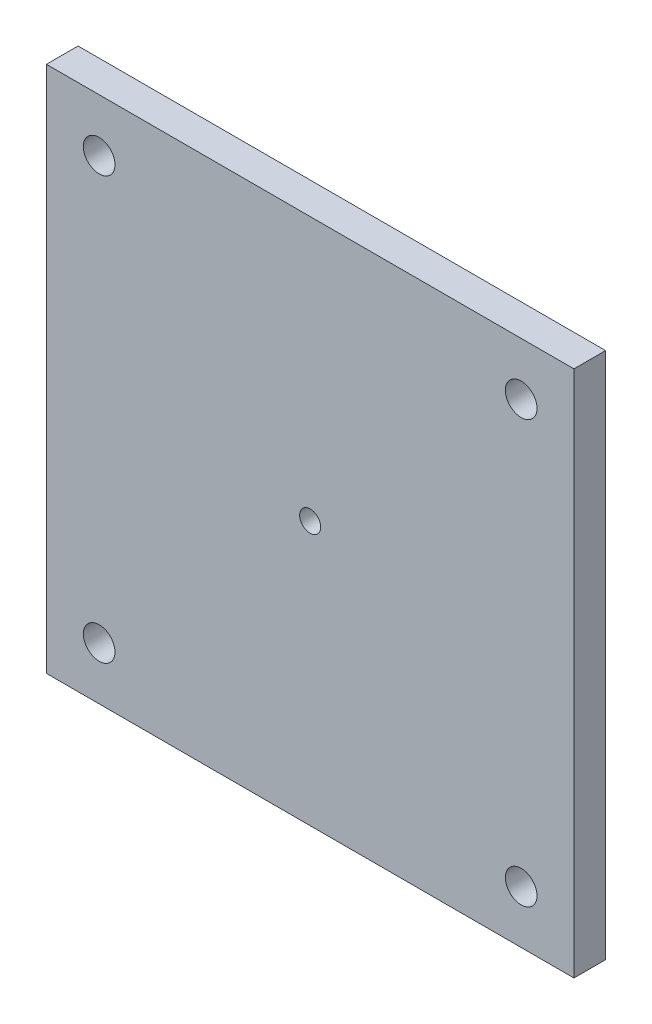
from build123d import *

# Parameters (mm, degrees)
CROQUIS1_W              = 50
CROQUIS1_H              = 50
CROQUIS1_R              = 1.5
CROQUIS1_R_2            = 1
SALIENTE_EXTRUIR1_DEPTH = 3


with BuildPart() as part:
    # Croquis1 → Saliente-Extruir1 (new body)
    with BuildSketch(Plane.XY):
        Rectangle(CROQUIS1_W, CROQUIS1_H)
        with Locations((-20, 20)):
            Circle(CROQUIS1_R, mode=Mode.SUBTRACT)
        with Locations((20, 20)):
            Circle(CROQUIS1_R, mode=Mode.SUBTRACT)
        with Locations((20, -20)):
            Circle(CROQUIS1_R, mode=Mode.SUBTRACT)
        with Locations((-20, -20)):
            Circle(CROQUIS1_R, mode=Mode.SUBTRACT)
        Circle(CROQUIS1_R_2, mode=Mode.SUBTRACT)
    extrude(amount=SALIENTE_EXTRUIR1_DEPTH)


solid = part.part
